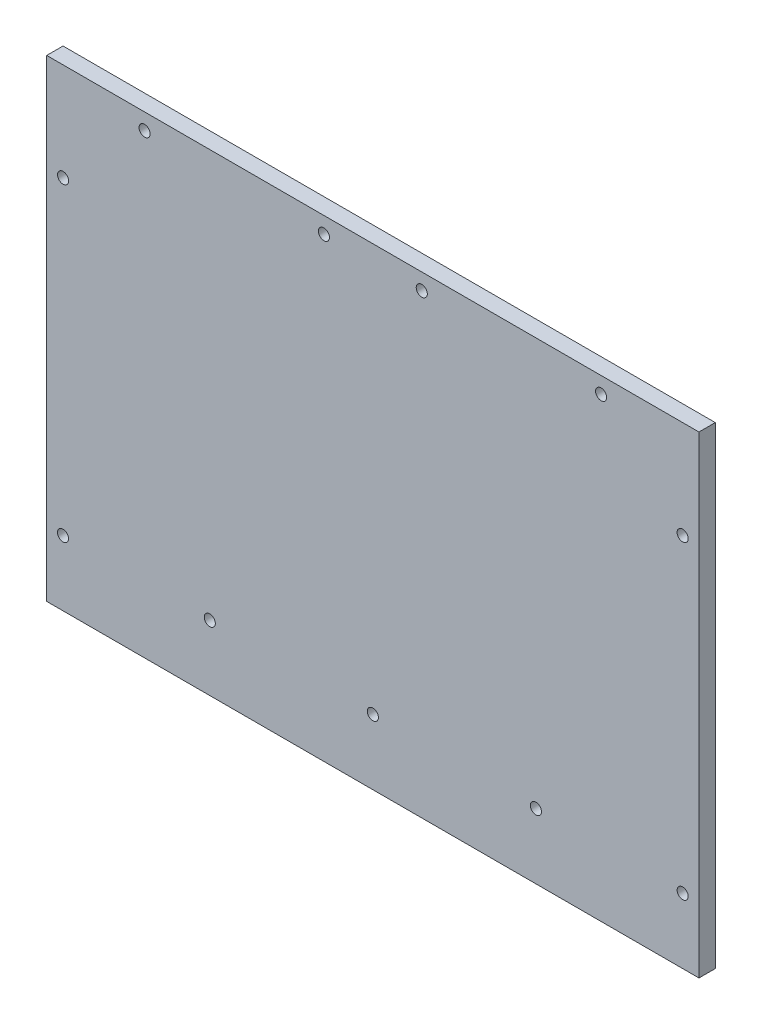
from build123d import *

# Parameters (mm, degrees)
SKETCH_1_W                   = 200
SKETCH_1_H                   = 145
EXTRUDE_1_DEPTH              = 5
HOLE_WIZARD_M3_1_D           = 3.4
HOLE_WIZARD_M3_1_DEPTH       = 11.5
HOLE_WIZARD_M3_1_CSINK_D     = 6.6
HOLE_WIZARD_M3_1_CSINK_ANGLE = 90
HOLE_WIZARD_M3_1_TIP         = 1.021463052
HOLE_WIZARD_M3_3_D           = 3.4
HOLE_WIZARD_M3_3_DEPTH       = 7
HOLE_WIZARD_M3_3_CSINK_D     = 6.6
HOLE_WIZARD_M3_3_CSINK_ANGLE = 90
HOLE_WIZARD_M3_3_TIP         = 1.021463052
HOLE_WIZARD_M3_4_D           = 3.4
HOLE_WIZARD_M3_4_CSINK_D     = 6.6
HOLE_WIZARD_M3_4_CSINK_ANGLE = 90


with BuildPart() as part:
    # Sketch 1 → Extrude 1 (new body)
    with BuildSketch(Plane.XY):
        Rectangle(SKETCH_1_W, SKETCH_1_H)
    extrude(amount=EXTRUDE_1_DEPTH)

    # Hole Wizard M3 _1
    with Locations(Plane(origin=(0, 0, 0), x_dir=(-1, 0, 0), z_dir=(0, 0, -1))):
        with Locations((-70, 67.5), (70, 67.5), (-95, -52.5), (95, -52.5), (-15, 67.5), (15, 67.5)):
            CounterSinkHole(HOLE_WIZARD_M3_1_D / 2, HOLE_WIZARD_M3_1_CSINK_D / 2, depth=HOLE_WIZARD_M3_1_DEPTH, counter_sink_angle=HOLE_WIZARD_M3_1_CSINK_ANGLE)
            with Locations((0, 0, -(HOLE_WIZARD_M3_1_DEPTH + HOLE_WIZARD_M3_1_TIP / 2))):  # 118° drill point
                Cone(0, HOLE_WIZARD_M3_1_D / 2, HOLE_WIZARD_M3_1_TIP, mode=Mode.SUBTRACT)

    # Hole Wizard M3 _3
    with Locations(Plane(origin=(0, 0, 0), x_dir=(-1, 0, 0), z_dir=(0, 0, -1))):
        with Locations((-50, -52.5), (0, -52.5), (50, -52.5)):
            CounterSinkHole(HOLE_WIZARD_M3_3_D / 2, HOLE_WIZARD_M3_3_CSINK_D / 2, depth=HOLE_WIZARD_M3_3_DEPTH, counter_sink_angle=HOLE_WIZARD_M3_3_CSINK_ANGLE)
            with Locations((0, 0, -(HOLE_WIZARD_M3_3_DEPTH + HOLE_WIZARD_M3_3_TIP / 2))):  # 118° drill point
                Cone(0, HOLE_WIZARD_M3_3_D / 2, HOLE_WIZARD_M3_3_TIP, mode=Mode.SUBTRACT)

    # Hole Wizard M3 _4 (through all)
    with Locations(Plane(origin=(0, 0, 0), x_dir=(-1, 0, 0), z_dir=(0, 0, -1))):
        with Locations((-95, 42.5), (95, 42.5)):
            CounterSinkHole(HOLE_WIZARD_M3_4_D / 2, HOLE_WIZARD_M3_4_CSINK_D / 2, counter_sink_angle=HOLE_WIZARD_M3_4_CSINK_ANGLE)


solid = part.part
